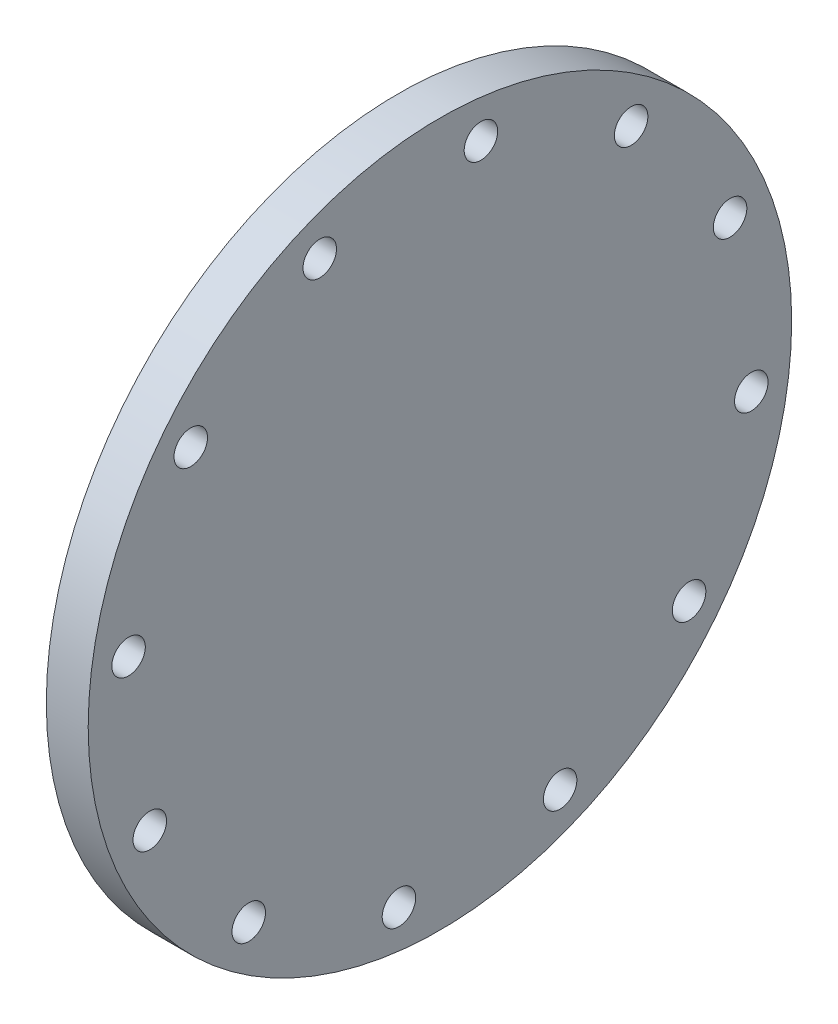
from build123d import *

# Parameters (mm, degrees)
SKETCH2_R        = 12.7
BOLTHOLE_DEPTH   = 379.641213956
BOLTCIRCLE_COUNT = 12
BOLTCIRCLE_ANGLE = 330


with BuildPart() as part:
    # Profile → Base-Revolve (revolve)
    with BuildSketch(Plane.XY, mode=Mode.PRIVATE) as base_revolve_sk:
        Polygon((0, 0), (0, 206.375), (1.5875, 206.375), (1.5875, 266.7), (33.3375, 266.7), (33.3375, 0), align=None)
    revolve(base_revolve_sk.sketch.rotate(Axis((0, 0, 0), (1, 0, 0)), 90), axis=Axis((0, 0, 0), (1, 0, 0)))

    # Sketch2 → BoltHole (cut, through all)
    with BuildSketch(Plane(origin=(33.3375, 0, 0), x_dir=(0, 0, -1), z_dir=(1, 0, 0))):
        with Locations((-91.126492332, 219.998813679)):
            Circle(SKETCH2_R)
    bolthole = extrude(amount=-BOLTHOLE_DEPTH, mode=Mode.SUBTRACT)

    # BoltCircle: BoltHole ×12 about axis
    boltcircle_axis = Axis((0, 0, 0), (1, 0, 0))
    for i in range(1, BOLTCIRCLE_COUNT):
        add(bolthole.rotate(boltcircle_axis, i * BOLTCIRCLE_ANGLE / (BOLTCIRCLE_COUNT - 1)), mode=Mode.SUBTRACT)


solid = part.part
